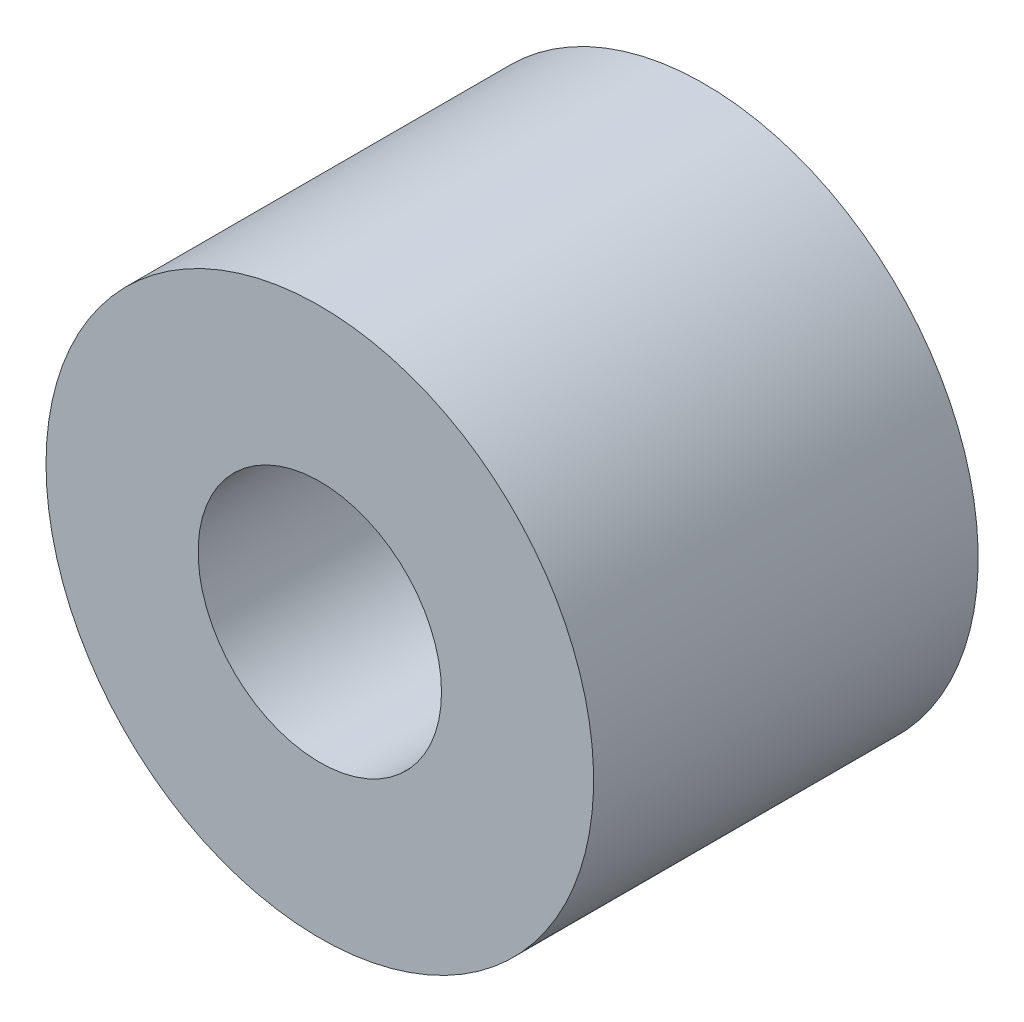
ISO-10303-21;
HEADER;
FILE_DESCRIPTION(('STEP AP214'),'2;1');
FILE_NAME('part.step','',(''),(''),'','','');
FILE_SCHEMA(('AUTOMOTIVE_DESIGN { 1 0 10303 214 1 1 1 1 }'));
ENDSEC;
DATA;
#1=APPLICATION_CONTEXT('core data for automotive mechanical design processes');
#2=APPLICATION_PROTOCOL_DEFINITION('international standard','automotive_design',2000,#1);
#3=PRODUCT_CONTEXT('',#1,'mechanical');
#4=PRODUCT('Part','Part','',(#3));
#5=PRODUCT_RELATED_PRODUCT_CATEGORY('part','',(#4));
#6=PRODUCT_DEFINITION_FORMATION('','',#4);
#7=PRODUCT_DEFINITION_CONTEXT('part definition',#1,'design');
#8=PRODUCT_DEFINITION('design','',#6,#7);
#9=PRODUCT_DEFINITION_SHAPE('','',#8);
#10=(LENGTH_UNIT() NAMED_UNIT(*) SI_UNIT(.MILLI.,.METRE.));
#11=(NAMED_UNIT(*) PLANE_ANGLE_UNIT() SI_UNIT($,.RADIAN.));
#12=(NAMED_UNIT(*) SI_UNIT($,.STERADIAN.) SOLID_ANGLE_UNIT());
#13=UNCERTAINTY_MEASURE_WITH_UNIT(LENGTH_MEASURE(1.E-05),#10,'distance_accuracy_value','');
#14=(GEOMETRIC_REPRESENTATION_CONTEXT(3) GLOBAL_UNCERTAINTY_ASSIGNED_CONTEXT((#13)) GLOBAL_UNIT_ASSIGNED_CONTEXT((#10,
#11,#12)) REPRESENTATION_CONTEXT('',''));
#15=CARTESIAN_POINT('',(0.,0.,0.));
#16=DIRECTION('',(0.,0.,1.));
#17=DIRECTION('',(1.,0.,0.));
#18=AXIS2_PLACEMENT_3D('',#15,#16,#17);
#19=CARTESIAN_POINT('',(0.,0.,16.1644610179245));
#20=DIRECTION('',(0.,0.,-1.));
#21=DIRECTION('',(-1.,0.,0.));
#22=AXIS2_PLACEMENT_3D('',#19,#20,#21);
#23=CYLINDRICAL_SURFACE('',#22,5.715);
#24=CARTESIAN_POINT('',(0.,0.,0.));
#25=DIRECTION('',(0.,0.,-1.));
#26=DIRECTION('',(-1.,0.,0.));
#27=AXIS2_PLACEMENT_3D('',#24,#25,#26);
#28=CIRCLE('',#27,5.715);
#29=CARTESIAN_POINT('',(-5.715,0.,0.));
#30=VERTEX_POINT('',#29);
#31=EDGE_CURVE('E43',#30,#30,#28,.F.);
#32=ORIENTED_EDGE('',*,*,#31,.F.);
#33=EDGE_LOOP('',(#32));
#34=FACE_BOUND('',#33,.T.);
#35=CARTESIAN_POINT('',(0.,0.,-8.0264));
#36=DIRECTION('',(0.,0.,-1.));
#37=DIRECTION('',(-1.,0.,0.));
#38=AXIS2_PLACEMENT_3D('',#35,#36,#37);
#39=CIRCLE('',#38,5.715);
#40=CARTESIAN_POINT('',(-5.715,0.,-8.0264));
#41=VERTEX_POINT('',#40);
#42=EDGE_CURVE('E47',#41,#41,#39,.T.);
#43=ORIENTED_EDGE('',*,*,#42,.F.);
#44=EDGE_LOOP('',(#43));
#45=FACE_BOUND('',#44,.T.);
#46=ADVANCED_FACE('F32',(#34,#45),#23,.T.);
#47=CARTESIAN_POINT('',(0.,3.0734,-8.0264));
#48=DIRECTION('',(0.,0.,1.));
#49=DIRECTION('',(1.,0.,0.));
#50=AXIS2_PLACEMENT_3D('',#47,#48,#49);
#51=PLANE('',#50);
#52=CARTESIAN_POINT('',(0.,0.,-8.0264));
#53=DIRECTION('',(0.,0.,1.));
#54=DIRECTION('',(1.,0.,0.));
#55=AXIS2_PLACEMENT_3D('',#52,#53,#54);
#56=CIRCLE('',#55,2.54);
#57=CARTESIAN_POINT('',(2.54,0.,-8.0264));
#58=VERTEX_POINT('',#57);
#59=EDGE_CURVE('E10',#58,#58,#56,.F.);
#60=ORIENTED_EDGE('',*,*,#59,.F.);
#61=EDGE_LOOP('',(#60));
#62=FACE_BOUND('',#61,.T.);
#63=ORIENTED_EDGE('',*,*,#42,.T.);
#64=EDGE_LOOP('',(#63));
#65=FACE_BOUND('',#64,.T.);
#66=ADVANCED_FACE('F34',(#62,#65),#51,.F.);
#67=CARTESIAN_POINT('',(0.,3.0734,0.));
#68=DIRECTION('',(0.,0.,-1.));
#69=DIRECTION('',(-1.,0.,0.));
#70=AXIS2_PLACEMENT_3D('',#67,#68,#69);
#71=PLANE('',#70);
#72=CARTESIAN_POINT('',(0.,0.,0.));
#73=DIRECTION('',(0.,0.,1.));
#74=DIRECTION('',(1.,0.,0.));
#75=AXIS2_PLACEMENT_3D('',#72,#73,#74);
#76=CIRCLE('',#75,2.54);
#77=CARTESIAN_POINT('',(2.54,0.,0.));
#78=VERTEX_POINT('',#77);
#79=EDGE_CURVE('E39',#78,#78,#76,.T.);
#80=ORIENTED_EDGE('',*,*,#79,.F.);
#81=EDGE_LOOP('',(#80));
#82=FACE_BOUND('',#81,.T.);
#83=ORIENTED_EDGE('',*,*,#31,.T.);
#84=EDGE_LOOP('',(#83));
#85=FACE_BOUND('',#84,.T.);
#86=ADVANCED_FACE('F57',(#82,#85),#71,.F.);
#87=CARTESIAN_POINT('',(0.,0.,-22.6013556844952));
#88=DIRECTION('',(0.,0.,1.));
#89=DIRECTION('',(1.,0.,0.));
#90=AXIS2_PLACEMENT_3D('',#87,#88,#89);
#91=CYLINDRICAL_SURFACE('',#90,2.54);
#92=ORIENTED_EDGE('',*,*,#59,.T.);
#93=EDGE_LOOP('',(#92));
#94=FACE_BOUND('',#93,.T.);
#95=ORIENTED_EDGE('',*,*,#79,.T.);
#96=EDGE_LOOP('',(#95));
#97=FACE_BOUND('',#96,.T.);
#98=ADVANCED_FACE('F62',(#94,#97),#91,.F.);
#99=CLOSED_SHELL('',(#46,#66,#86,#98));
#100=MANIFOLD_SOLID_BREP('B2',#99);
#101=ADVANCED_BREP_SHAPE_REPRESENTATION('',(#18,#100),#14);
#102=SHAPE_DEFINITION_REPRESENTATION(#9,#101);
ENDSEC;
END-ISO-10303-21;
